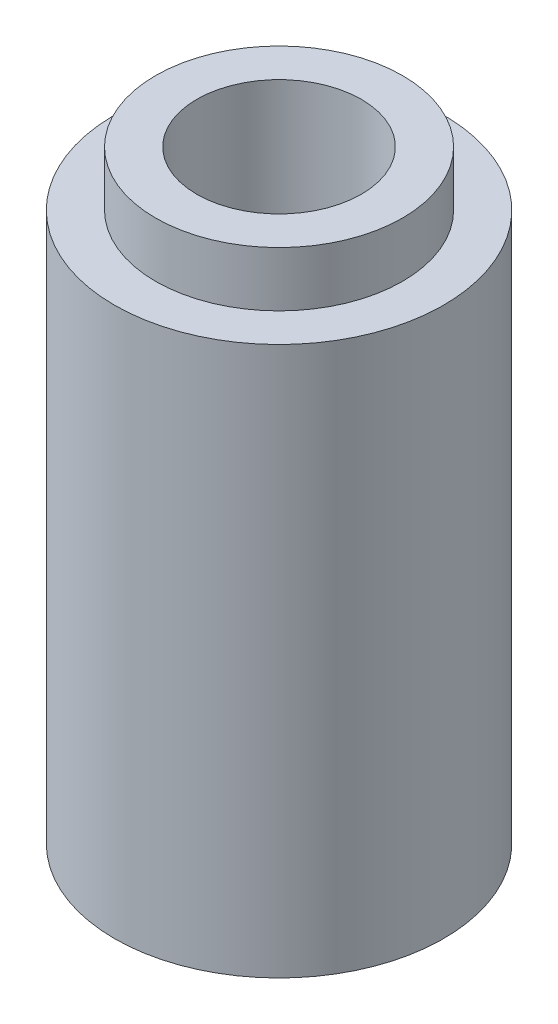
from build123d import *

# Parameters (mm, degrees)
SKETCH_1_R          = 3
EXTRUDE_1_DEPTH     = 10
SKETCH_2_R          = 2.25
EXTRUDE_2_DEPTH     = 1
SKETCH_3_R          = 1.5
CUT_EXTRUDE_1_DEPTH = 11


with BuildPart() as part:
    # Sketch 1 → Extrude 1 (new body)
    with BuildSketch(Plane(origin=(0, 0, 0), x_dir=(1, 0, 0), z_dir=(0, 1, 0))):
        with Locations(Location((0, 0, 0), (0, 0, 270))):
            Circle(SKETCH_1_R)
    extrude(amount=EXTRUDE_1_DEPTH)

    # Sketch 2 → Extrude 2 (add)
    with BuildSketch(Plane(origin=(0, 10, 0), x_dir=(1, 0, 0), z_dir=(0, 1, 0))):
        with Locations(Location((0, 0, 0), (0, 0, 270))):
            Circle(SKETCH_2_R)
    extrude(amount=EXTRUDE_2_DEPTH)

    # Sketch 3 → Cut-Extrude 1 (cut)
    with BuildSketch(Plane.XZ):
        with Locations(Location((0, 0, 0), (0, 0, 270))):
            Circle(SKETCH_3_R)
    extrude(amount=-CUT_EXTRUDE_1_DEPTH, mode=Mode.SUBTRACT)


solid = part.part
